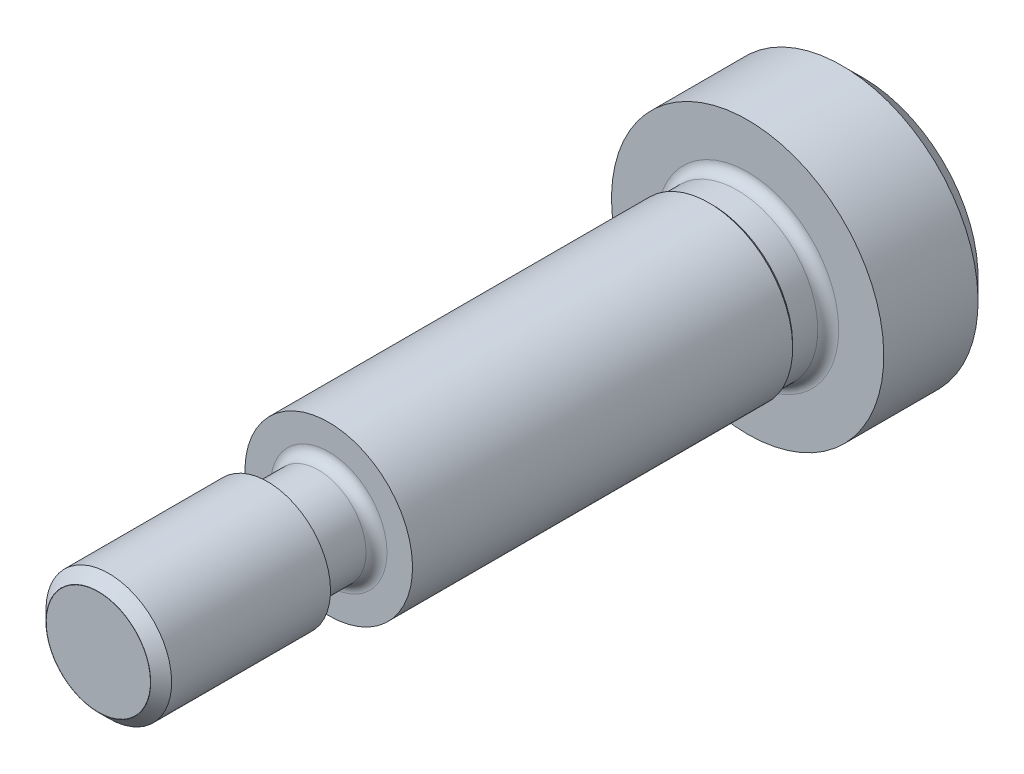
ISO-10303-21;
HEADER;
FILE_DESCRIPTION(('STEP AP214'),'2;1');
FILE_NAME('part.step','',(''),(''),'','','');
FILE_SCHEMA(('AUTOMOTIVE_DESIGN { 1 0 10303 214 1 1 1 1 }'));
ENDSEC;
DATA;
#1=APPLICATION_CONTEXT('core data for automotive mechanical design processes');
#2=APPLICATION_PROTOCOL_DEFINITION('international standard','automotive_design',2000,#1);
#3=PRODUCT_CONTEXT('',#1,'mechanical');
#4=PRODUCT('Part','Part','',(#3));
#5=PRODUCT_RELATED_PRODUCT_CATEGORY('part','',(#4));
#6=PRODUCT_DEFINITION_FORMATION('','',#4);
#7=PRODUCT_DEFINITION_CONTEXT('part definition',#1,'design');
#8=PRODUCT_DEFINITION('design','',#6,#7);
#9=PRODUCT_DEFINITION_SHAPE('','',#8);
#10=(LENGTH_UNIT() NAMED_UNIT(*) SI_UNIT(.MILLI.,.METRE.));
#11=(NAMED_UNIT(*) PLANE_ANGLE_UNIT() SI_UNIT($,.RADIAN.));
#12=(NAMED_UNIT(*) SI_UNIT($,.STERADIAN.) SOLID_ANGLE_UNIT());
#13=UNCERTAINTY_MEASURE_WITH_UNIT(LENGTH_MEASURE(1.E-05),#10,'distance_accuracy_value','');
#14=(GEOMETRIC_REPRESENTATION_CONTEXT(3) GLOBAL_UNCERTAINTY_ASSIGNED_CONTEXT((#13)) GLOBAL_UNIT_ASSIGNED_CONTEXT((#10,
#11,#12)) REPRESENTATION_CONTEXT('',''));
#15=CARTESIAN_POINT('',(0.,0.,0.));
#16=DIRECTION('',(0.,0.,1.));
#17=DIRECTION('',(1.,0.,0.));
#18=AXIS2_PLACEMENT_3D('',#15,#16,#17);
#19=CARTESIAN_POINT('',(0.,6.5,0.));
#20=DIRECTION('',(0.,0.,-1.));
#21=DIRECTION('',(0.,1.,0.));
#22=AXIS2_PLACEMENT_3D('',#19,#20,#21);
#23=PLANE('',#22);
#24=CARTESIAN_POINT('',(0.,0.,0.));
#25=DIRECTION('',(0.,0.,1.));
#26=DIRECTION('',(0.,-1.,0.));
#27=AXIS2_PLACEMENT_3D('',#24,#25,#26);
#28=CIRCLE('',#27,4.35);
#29=CARTESIAN_POINT('',(0.,-4.35,0.));
#30=VERTEX_POINT('',#29);
#31=EDGE_CURVE('E211',#30,#30,#28,.T.);
#32=ORIENTED_EDGE('',*,*,#31,.F.);
#33=EDGE_LOOP('',(#32));
#34=FACE_BOUND('',#33,.T.);
#35=CARTESIAN_POINT('',(0.,0.,0.));
#36=DIRECTION('',(0.,0.,1.));
#37=DIRECTION('',(0.,-1.,0.));
#38=AXIS2_PLACEMENT_3D('',#35,#36,#37);
#39=CIRCLE('',#38,6.5);
#40=CARTESIAN_POINT('',(0.,-6.5,0.));
#41=VERTEX_POINT('',#40);
#42=EDGE_CURVE('E149',#41,#41,#39,.T.);
#43=ORIENTED_EDGE('',*,*,#42,.T.);
#44=EDGE_LOOP('',(#43));
#45=FACE_BOUND('',#44,.T.);
#46=ADVANCED_FACE('F36',(#34,#45),#23,.F.);
#47=CARTESIAN_POINT('',(0.,0.,0.5));
#48=DIRECTION('',(0.,0.,1.));
#49=DIRECTION('',(0.,-1.,0.));
#50=AXIS2_PLACEMENT_3D('',#47,#48,#49);
#51=TOROIDAL_SURFACE('',#50,4.35,0.499999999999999);
#52=CARTESIAN_POINT('',(0.,0.,0.5));
#53=DIRECTION('',(0.,0.,1.));
#54=DIRECTION('',(0.,-1.,0.));
#55=AXIS2_PLACEMENT_3D('',#52,#53,#54);
#56=CIRCLE('',#55,3.85);
#57=CARTESIAN_POINT('',(0.,-3.85,0.5));
#58=VERTEX_POINT('',#57);
#59=EDGE_CURVE('E208',#58,#58,#56,.T.);
#60=ORIENTED_EDGE('',*,*,#59,.F.);
#61=EDGE_LOOP('',(#60));
#62=FACE_BOUND('',#61,.T.);
#63=ORIENTED_EDGE('',*,*,#31,.T.);
#64=EDGE_LOOP('',(#63));
#65=FACE_BOUND('',#64,.T.);
#66=ADVANCED_FACE('F274',(#62,#65),#51,.F.);
#67=CARTESIAN_POINT('',(0.,0.,-0.998278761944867));
#68=DIRECTION('',(0.,0.,1.));
#69=DIRECTION('',(0.,-1.,0.));
#70=AXIS2_PLACEMENT_3D('',#67,#68,#69);
#71=CYLINDRICAL_SURFACE('',#70,3.85);
#72=CARTESIAN_POINT('',(0.,0.,1.7));
#73=DIRECTION('',(0.,0.,1.));
#74=DIRECTION('',(0.,-1.,0.));
#75=AXIS2_PLACEMENT_3D('',#72,#73,#74);
#76=CIRCLE('',#75,3.85);
#77=CARTESIAN_POINT('',(0.,-3.85,1.7));
#78=VERTEX_POINT('',#77);
#79=EDGE_CURVE('E205',#78,#78,#76,.T.);
#80=ORIENTED_EDGE('',*,*,#79,.F.);
#81=EDGE_LOOP('',(#80));
#82=FACE_BOUND('',#81,.T.);
#83=ORIENTED_EDGE('',*,*,#59,.T.);
#84=EDGE_LOOP('',(#83));
#85=FACE_BOUND('',#84,.T.);
#86=ADVANCED_FACE('F279',(#82,#85),#71,.T.);
#87=CARTESIAN_POINT('',(0.,0.,1.7));
#88=DIRECTION('',(0.,0.,1.));
#89=DIRECTION('',(0.,-1.,0.));
#90=AXIS2_PLACEMENT_3D('',#87,#88,#89);
#91=CONICAL_SURFACE('',#90,3.85,0.785398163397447);
#92=CARTESIAN_POINT('',(0.,0.,1.85));
#93=DIRECTION('',(0.,0.,1.));
#94=DIRECTION('',(0.,-1.,0.));
#95=AXIS2_PLACEMENT_3D('',#92,#93,#94);
#96=CIRCLE('',#95,4.);
#97=CARTESIAN_POINT('',(0.,-4.,1.85));
#98=VERTEX_POINT('',#97);
#99=EDGE_CURVE('E202',#98,#98,#96,.T.);
#100=ORIENTED_EDGE('',*,*,#99,.F.);
#101=EDGE_LOOP('',(#100));
#102=FACE_BOUND('',#101,.T.);
#103=ORIENTED_EDGE('',*,*,#79,.T.);
#104=EDGE_LOOP('',(#103));
#105=FACE_BOUND('',#104,.T.);
#106=ADVANCED_FACE('F346',(#102,#105),#91,.T.);
#107=CARTESIAN_POINT('',(0.,0.,-0.998278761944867));
#108=DIRECTION('',(0.,0.,1.));
#109=DIRECTION('',(0.,-1.,0.));
#110=AXIS2_PLACEMENT_3D('',#107,#108,#109);
#111=CYLINDRICAL_SURFACE('',#110,4.);
#112=CARTESIAN_POINT('',(0.,0.,20.));
#113=DIRECTION('',(0.,0.,1.));
#114=DIRECTION('',(0.,-1.,0.));
#115=AXIS2_PLACEMENT_3D('',#112,#113,#114);
#116=CIRCLE('',#115,4.);
#117=CARTESIAN_POINT('',(0.,-4.,20.));
#118=VERTEX_POINT('',#117);
#119=EDGE_CURVE('E199',#118,#118,#116,.T.);
#120=ORIENTED_EDGE('',*,*,#119,.F.);
#121=EDGE_LOOP('',(#120));
#122=FACE_BOUND('',#121,.T.);
#123=ORIENTED_EDGE('',*,*,#99,.T.);
#124=EDGE_LOOP('',(#123));
#125=FACE_BOUND('',#124,.T.);
#126=ADVANCED_FACE('F342',(#122,#125),#111,.T.);
#127=CARTESIAN_POINT('',(0.,4.,20.));
#128=DIRECTION('',(0.,0.,-1.));
#129=DIRECTION('',(0.,1.,0.));
#130=AXIS2_PLACEMENT_3D('',#127,#128,#129);
#131=PLANE('',#130);
#132=CARTESIAN_POINT('',(0.,0.,20.));
#133=DIRECTION('',(0.,0.,1.));
#134=DIRECTION('',(0.,-1.,0.));
#135=AXIS2_PLACEMENT_3D('',#132,#133,#134);
#136=CIRCLE('',#135,2.78);
#137=CARTESIAN_POINT('',(0.,-2.78,20.));
#138=VERTEX_POINT('',#137);
#139=EDGE_CURVE('E196',#138,#138,#136,.T.);
#140=ORIENTED_EDGE('',*,*,#139,.F.);
#141=EDGE_LOOP('',(#140));
#142=FACE_BOUND('',#141,.T.);
#143=ORIENTED_EDGE('',*,*,#119,.T.);
#144=EDGE_LOOP('',(#143));
#145=FACE_BOUND('',#144,.T.);
#146=ADVANCED_FACE('F338',(#142,#145),#131,.F.);
#147=CARTESIAN_POINT('',(0.,0.,20.5));
#148=DIRECTION('',(0.,0.,1.));
#149=DIRECTION('',(0.,-1.,0.));
#150=AXIS2_PLACEMENT_3D('',#147,#148,#149);
#151=TOROIDAL_SURFACE('',#150,2.78,0.5);
#152=CARTESIAN_POINT('',(0.,0.,20.5));
#153=DIRECTION('',(0.,0.,1.));
#154=DIRECTION('',(0.,-1.,0.));
#155=AXIS2_PLACEMENT_3D('',#152,#153,#154);
#156=CIRCLE('',#155,2.28);
#157=CARTESIAN_POINT('',(0.,-2.28,20.5));
#158=VERTEX_POINT('',#157);
#159=EDGE_CURVE('E193',#158,#158,#156,.T.);
#160=ORIENTED_EDGE('',*,*,#159,.F.);
#161=EDGE_LOOP('',(#160));
#162=FACE_BOUND('',#161,.T.);
#163=ORIENTED_EDGE('',*,*,#139,.T.);
#164=EDGE_LOOP('',(#163));
#165=FACE_BOUND('',#164,.T.);
#166=ADVANCED_FACE('F334',(#162,#165),#151,.F.);
#167=CARTESIAN_POINT('',(0.,0.,-0.998278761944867));
#168=DIRECTION('',(0.,0.,1.));
#169=DIRECTION('',(0.,-1.,0.));
#170=AXIS2_PLACEMENT_3D('',#167,#168,#169);
#171=CYLINDRICAL_SURFACE('',#170,2.28);
#172=CARTESIAN_POINT('',(0.,0.,22.5));
#173=DIRECTION('',(0.,0.,1.));
#174=DIRECTION('',(0.,-1.,0.));
#175=AXIS2_PLACEMENT_3D('',#172,#173,#174);
#176=CIRCLE('',#175,2.28);
#177=CARTESIAN_POINT('',(0.,-2.28,22.5));
#178=VERTEX_POINT('',#177);
#179=EDGE_CURVE('E190',#178,#178,#176,.T.);
#180=ORIENTED_EDGE('',*,*,#179,.F.);
#181=EDGE_LOOP('',(#180));
#182=FACE_BOUND('',#181,.T.);
#183=ORIENTED_EDGE('',*,*,#159,.T.);
#184=EDGE_LOOP('',(#183));
#185=FACE_BOUND('',#184,.T.);
#186=ADVANCED_FACE('F330',(#182,#185),#171,.T.);
#187=CARTESIAN_POINT('',(0.,0.,22.5));
#188=DIRECTION('',(0.,0.,1.));
#189=DIRECTION('',(0.,-1.,0.));
#190=AXIS2_PLACEMENT_3D('',#187,#188,#189);
#191=CONICAL_SURFACE('',#190,2.28,1.0471975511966);
#192=CARTESIAN_POINT('',(0.,0.,22.9156921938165));
#193=DIRECTION('',(0.,0.,1.));
#194=DIRECTION('',(0.,-1.,0.));
#195=AXIS2_PLACEMENT_3D('',#192,#193,#194);
#196=CIRCLE('',#195,3.);
#197=CARTESIAN_POINT('',(0.,-3.,22.9156921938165));
#198=VERTEX_POINT('',#197);
#199=EDGE_CURVE('E187',#198,#198,#196,.T.);
#200=ORIENTED_EDGE('',*,*,#199,.F.);
#201=EDGE_LOOP('',(#200));
#202=FACE_BOUND('',#201,.T.);
#203=ORIENTED_EDGE('',*,*,#179,.T.);
#204=EDGE_LOOP('',(#203));
#205=FACE_BOUND('',#204,.T.);
#206=ADVANCED_FACE('F326',(#202,#205),#191,.T.);
#207=CARTESIAN_POINT('',(0.,0.,-0.998278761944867));
#208=DIRECTION('',(0.,0.,1.));
#209=DIRECTION('',(0.,-1.,0.));
#210=AXIS2_PLACEMENT_3D('',#207,#208,#209);
#211=CYLINDRICAL_SURFACE('',#210,3.);
#212=CARTESIAN_POINT('',(0.,0.,30.5));
#213=DIRECTION('',(0.,0.,1.));
#214=DIRECTION('',(0.,-1.,0.));
#215=AXIS2_PLACEMENT_3D('',#212,#213,#214);
#216=CIRCLE('',#215,3.);
#217=CARTESIAN_POINT('',(0.,-3.,30.5));
#218=VERTEX_POINT('',#217);
#219=EDGE_CURVE('E184',#218,#218,#216,.T.);
#220=ORIENTED_EDGE('',*,*,#219,.F.);
#221=EDGE_LOOP('',(#220));
#222=FACE_BOUND('',#221,.T.);
#223=ORIENTED_EDGE('',*,*,#199,.T.);
#224=EDGE_LOOP('',(#223));
#225=FACE_BOUND('',#224,.T.);
#226=ADVANCED_FACE('F322',(#222,#225),#211,.T.);
#227=CARTESIAN_POINT('',(0.,0.,30.5));
#228=DIRECTION('',(0.,0.,-1.));
#229=DIRECTION('',(0.,1.,0.));
#230=AXIS2_PLACEMENT_3D('',#227,#228,#229);
#231=CONICAL_SURFACE('',#230,3.,0.785398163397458);
#232=CARTESIAN_POINT('',(0.,0.,31.));
#233=DIRECTION('',(0.,0.,1.));
#234=DIRECTION('',(0.,-1.,0.));
#235=AXIS2_PLACEMENT_3D('',#232,#233,#234);
#236=CIRCLE('',#235,2.5);
#237=CARTESIAN_POINT('',(0.,-2.5,31.));
#238=VERTEX_POINT('',#237);
#239=EDGE_CURVE('E181',#238,#238,#236,.T.);
#240=ORIENTED_EDGE('',*,*,#239,.F.);
#241=EDGE_LOOP('',(#240));
#242=FACE_BOUND('',#241,.T.);
#243=ORIENTED_EDGE('',*,*,#219,.T.);
#244=EDGE_LOOP('',(#243));
#245=FACE_BOUND('',#244,.T.);
#246=ADVANCED_FACE('F318',(#242,#245),#231,.T.);
#247=CARTESIAN_POINT('',(0.,0.,-0.998278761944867));
#248=DIRECTION('',(0.,0.,1.));
#249=DIRECTION('',(0.,-1.,0.));
#250=AXIS2_PLACEMENT_3D('',#247,#248,#249);
#251=CYLINDRICAL_SURFACE('',#250,2.5);
#252=CARTESIAN_POINT('',(0.,0.,22.6385640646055));
#253=DIRECTION('',(0.,0.,1.));
#254=DIRECTION('',(0.,-1.,0.));
#255=AXIS2_PLACEMENT_3D('',#252,#253,#254);
#256=CIRCLE('',#255,2.5);
#257=CARTESIAN_POINT('',(0.,-2.5,22.6385640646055));
#258=VERTEX_POINT('',#257);
#259=EDGE_CURVE('E178',#258,#258,#256,.T.);
#260=ORIENTED_EDGE('',*,*,#259,.F.);
#261=EDGE_LOOP('',(#260));
#262=FACE_BOUND('',#261,.T.);
#263=ORIENTED_EDGE('',*,*,#239,.T.);
#264=EDGE_LOOP('',(#263));
#265=FACE_BOUND('',#264,.T.);
#266=ADVANCED_FACE('F314',(#262,#265),#251,.F.);
#267=CARTESIAN_POINT('',(0.,0.,22.6385640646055));
#268=DIRECTION('',(0.,0.,1.));
#269=DIRECTION('',(0.,-1.,0.));
#270=AXIS2_PLACEMENT_3D('',#267,#268,#269);
#271=CONICAL_SURFACE('',#270,2.5,1.04719755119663);
#272=CARTESIAN_POINT('',(0.,0.,22.6327905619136));
#273=DIRECTION('',(0.,0.,1.));
#274=DIRECTION('',(0.,-1.,0.));
#275=AXIS2_PLACEMENT_3D('',#272,#273,#274);
#276=CIRCLE('',#275,2.48999999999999);
#277=CARTESIAN_POINT('',(0.,-2.48999999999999,22.6327905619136));
#278=VERTEX_POINT('',#277);
#279=EDGE_CURVE('E175',#278,#278,#276,.T.);
#280=ORIENTED_EDGE('',*,*,#279,.F.);
#281=EDGE_LOOP('',(#280));
#282=FACE_BOUND('',#281,.T.);
#283=ORIENTED_EDGE('',*,*,#259,.T.);
#284=EDGE_LOOP('',(#283));
#285=FACE_BOUND('',#284,.T.);
#286=ADVANCED_FACE('F310',(#282,#285),#271,.F.);
#287=CARTESIAN_POINT('',(0.,0.,-0.998278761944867));
#288=DIRECTION('',(0.,0.,1.));
#289=DIRECTION('',(0.,-1.,0.));
#290=AXIS2_PLACEMENT_3D('',#287,#288,#289);
#291=CYLINDRICAL_SURFACE('',#290,2.48999999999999);
#292=CARTESIAN_POINT('',(0.,0.,31.));
#293=DIRECTION('',(0.,0.,1.));
#294=DIRECTION('',(0.,-1.,0.));
#295=AXIS2_PLACEMENT_3D('',#292,#293,#294);
#296=CIRCLE('',#295,2.48999999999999);
#297=CARTESIAN_POINT('',(0.,-2.48999999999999,31.));
#298=VERTEX_POINT('',#297);
#299=EDGE_CURVE('E171',#298,#298,#296,.T.);
#300=ORIENTED_EDGE('',*,*,#299,.F.);
#301=EDGE_LOOP('',(#300));
#302=FACE_BOUND('',#301,.T.);
#303=ORIENTED_EDGE('',*,*,#279,.T.);
#304=EDGE_LOOP('',(#303));
#305=FACE_BOUND('',#304,.T.);
#306=ADVANCED_FACE('F302',(#302,#305),#291,.T.);
#307=CARTESIAN_POINT('',(0.,2.48999999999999,31.));
#308=DIRECTION('',(0.,0.,-1.));
#309=DIRECTION('',(0.,1.,0.));
#310=AXIS2_PLACEMENT_3D('',#307,#308,#309);
#311=PLANE('',#310);
#312=ORIENTED_EDGE('',*,*,#299,.T.);
#313=EDGE_LOOP('',(#312));
#314=FACE_BOUND('',#313,.T.);
#315=ADVANCED_FACE('F297',(#314),#311,.F.);
#316=CARTESIAN_POINT('',(0.,2.,-5.5));
#317=DIRECTION('',(0.,0.,1.));
#318=DIRECTION('',(0.,-1.,0.));
#319=AXIS2_PLACEMENT_3D('',#316,#317,#318);
#320=PLANE('',#319);
#321=CARTESIAN_POINT('',(0.,0.,-5.5));
#322=DIRECTION('',(0.,0.,1.));
#323=DIRECTION('',(0.,-1.,0.));
#324=AXIS2_PLACEMENT_3D('',#321,#322,#323);
#325=CIRCLE('',#324,5.50000000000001);
#326=CARTESIAN_POINT('',(0.,-5.50000000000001,-5.5));
#327=VERTEX_POINT('',#326);
#328=EDGE_CURVE('E166',#327,#327,#325,.T.);
#329=ORIENTED_EDGE('',*,*,#328,.F.);
#330=EDGE_LOOP('',(#329));
#331=FACE_BOUND('',#330,.T.);
#332=DIRECTION('',(0.5,-0.866025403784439,0.));
#333=VECTOR('',#332,1.);
#334=CARTESIAN_POINT('',(-2.59807621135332,0.500000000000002,-5.5));
#335=LINE('',#334,#333);
#336=CARTESIAN_POINT('',(-2.3094010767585,0.,-5.5));
#337=VERTEX_POINT('',#336);
#338=CARTESIAN_POINT('',(-1.15470053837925,-2.00000000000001,-5.5));
#339=VERTEX_POINT('',#338);
#340=EDGE_CURVE('E57',#337,#339,#335,.T.);
#341=ORIENTED_EDGE('',*,*,#340,.T.);
#342=DIRECTION('',(1.,0.,0.));
#343=VECTOR('',#342,1.);
#344=CARTESIAN_POINT('',(0.,-2.,-5.5));
#345=LINE('',#344,#343);
#346=CARTESIAN_POINT('',(1.15470053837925,-2.,-5.5));
#347=VERTEX_POINT('',#346);
#348=EDGE_CURVE('E11',#339,#347,#345,.T.);
#349=ORIENTED_EDGE('',*,*,#348,.T.);
#350=DIRECTION('',(0.5,0.866025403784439,0.));
#351=VECTOR('',#350,1.);
#352=CARTESIAN_POINT('',(2.59807621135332,0.500000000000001,-5.5));
#353=LINE('',#352,#351);
#354=CARTESIAN_POINT('',(2.3094010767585,0.,-5.5));
#355=VERTEX_POINT('',#354);
#356=EDGE_CURVE('E43',#347,#355,#353,.T.);
#357=ORIENTED_EDGE('',*,*,#356,.T.);
#358=DIRECTION('',(-0.5,0.866025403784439,0.));
#359=VECTOR('',#358,1.);
#360=CARTESIAN_POINT('',(0.866025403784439,2.5,-5.5));
#361=LINE('',#360,#359);
#362=CARTESIAN_POINT('',(1.15470053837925,2.,-5.49999999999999));
#363=VERTEX_POINT('',#362);
#364=EDGE_CURVE('E219',#355,#363,#361,.T.);
#365=ORIENTED_EDGE('',*,*,#364,.T.);
#366=DIRECTION('',(-1.,0.,0.));
#367=VECTOR('',#366,1.);
#368=CARTESIAN_POINT('',(0.,2.,-5.5));
#369=LINE('',#368,#367);
#370=CARTESIAN_POINT('',(-1.15470053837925,2.,-5.49999999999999));
#371=VERTEX_POINT('',#370);
#372=EDGE_CURVE('E217',#363,#371,#369,.T.);
#373=ORIENTED_EDGE('',*,*,#372,.T.);
#374=DIRECTION('',(-0.5,-0.866025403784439,0.));
#375=VECTOR('',#374,1.);
#376=CARTESIAN_POINT('',(-0.866025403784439,2.5,-5.5));
#377=LINE('',#376,#375);
#378=EDGE_CURVE('E215',#371,#337,#377,.T.);
#379=ORIENTED_EDGE('',*,*,#378,.T.);
#380=EDGE_LOOP('',(#341,#349,#357,#365,#373,#379));
#381=FACE_BOUND('',#380,.T.);
#382=ADVANCED_FACE('F222',(#331,#381),#320,.F.);
#383=CARTESIAN_POINT('',(0.,0.,-5.5));
#384=DIRECTION('',(0.,0.,1.));
#385=DIRECTION('',(0.,-1.,0.));
#386=AXIS2_PLACEMENT_3D('',#383,#384,#385);
#387=CONICAL_SURFACE('',#386,5.50000000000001,0.785398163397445);
#388=CARTESIAN_POINT('',(0.,0.,-4.5));
#389=DIRECTION('',(0.,0.,1.));
#390=DIRECTION('',(0.,-1.,0.));
#391=AXIS2_PLACEMENT_3D('',#388,#389,#390);
#392=CIRCLE('',#391,6.5);
#393=CARTESIAN_POINT('',(0.,-6.5,-4.5));
#394=VERTEX_POINT('',#393);
#395=EDGE_CURVE('E163',#394,#394,#392,.T.);
#396=ORIENTED_EDGE('',*,*,#395,.F.);
#397=EDGE_LOOP('',(#396));
#398=FACE_BOUND('',#397,.T.);
#399=ORIENTED_EDGE('',*,*,#328,.T.);
#400=EDGE_LOOP('',(#399));
#401=FACE_BOUND('',#400,.T.);
#402=ADVANCED_FACE('F287',(#398,#401),#387,.T.);
#403=CARTESIAN_POINT('',(0.,0.,-0.998278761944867));
#404=DIRECTION('',(0.,0.,1.));
#405=DIRECTION('',(0.,-1.,0.));
#406=AXIS2_PLACEMENT_3D('',#403,#404,#405);
#407=CYLINDRICAL_SURFACE('',#406,6.5);
#408=ORIENTED_EDGE('',*,*,#42,.F.);
#409=EDGE_LOOP('',(#408));
#410=FACE_BOUND('',#409,.T.);
#411=ORIENTED_EDGE('',*,*,#395,.T.);
#412=EDGE_LOOP('',(#411));
#413=FACE_BOUND('',#412,.T.);
#414=ADVANCED_FACE('F272',(#410,#413),#407,.T.);
#415=CARTESIAN_POINT('',(0.,0.,-2.2));
#416=DIRECTION('',(0.,0.,-1.));
#417=DIRECTION('',(0.,1.,0.));
#418=AXIS2_PLACEMENT_3D('',#415,#416,#417);
#419=PLANE('',#418);
#420=CARTESIAN_POINT('',(0.,0.,-2.2));
#421=DIRECTION('',(0.,0.,1.));
#422=DIRECTION('',(0.,-1.,0.));
#423=AXIS2_PLACEMENT_3D('',#420,#421,#422);
#424=CIRCLE('',#423,2.);
#425=CARTESIAN_POINT('',(0.,1.99999999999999,-2.2));
#426=VERTEX_POINT('',#425);
#427=CARTESIAN_POINT('',(-1.73205080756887,0.999999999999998,-2.2));
#428=VERTEX_POINT('',#427);
#429=EDGE_CURVE('E244',#426,#428,#424,.T.);
#430=ORIENTED_EDGE('',*,*,#429,.T.);
#431=DIRECTION('',(0.5,0.866025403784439,0.));
#432=VECTOR('',#431,1.);
#433=CARTESIAN_POINT('',(-2.3094010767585,0.,-2.2));
#434=LINE('',#433,#432);
#435=CARTESIAN_POINT('',(-1.15470053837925,1.99999999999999,-2.2));
#436=VERTEX_POINT('',#435);
#437=EDGE_CURVE('E132',#428,#436,#434,.T.);
#438=ORIENTED_EDGE('',*,*,#437,.T.);
#439=DIRECTION('',(1.,0.,0.));
#440=VECTOR('',#439,1.);
#441=CARTESIAN_POINT('',(-1.15470053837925,1.99999999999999,-2.2));
#442=LINE('',#441,#440);
#443=EDGE_CURVE('E139',#436,#426,#442,.T.);
#444=ORIENTED_EDGE('',*,*,#443,.T.);
#445=EDGE_LOOP('',(#430,#438,#444));
#446=FACE_BOUND('',#445,.T.);
#447=ADVANCED_FACE('F258',(#446),#419,.T.);
#448=CARTESIAN_POINT('',(-1.73205080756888,-1.,-2.20000000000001));
#449=VERTEX_POINT('',#448);
#450=EDGE_CURVE('E246',#428,#449,#424,.T.);
#451=ORIENTED_EDGE('',*,*,#450,.T.);
#452=DIRECTION('',(-0.5,0.866025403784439,0.));
#453=VECTOR('',#452,1.);
#454=CARTESIAN_POINT('',(-1.15470053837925,-2.00000000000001,-2.20000000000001));
#455=LINE('',#454,#453);
#456=CARTESIAN_POINT('',(-2.3094010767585,0.,-2.2));
#457=VERTEX_POINT('',#456);
#458=EDGE_CURVE('E131',#449,#457,#455,.T.);
#459=ORIENTED_EDGE('',*,*,#458,.T.);
#460=EDGE_CURVE('E134',#457,#428,#434,.T.);
#461=ORIENTED_EDGE('',*,*,#460,.T.);
#462=EDGE_LOOP('',(#451,#459,#461));
#463=FACE_BOUND('',#462,.T.);
#464=ADVANCED_FACE('F251',(#463),#419,.T.);
#465=CARTESIAN_POINT('',(0.,-2.00000000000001,-2.20000000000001));
#466=VERTEX_POINT('',#465);
#467=EDGE_CURVE('E114',#449,#466,#424,.T.);
#468=ORIENTED_EDGE('',*,*,#467,.T.);
#469=DIRECTION('',(-1.,0.,0.));
#470=VECTOR('',#469,1.);
#471=CARTESIAN_POINT('',(1.15470053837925,-2.00000000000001,-2.20000000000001));
#472=LINE('',#471,#470);
#473=CARTESIAN_POINT('',(-1.15470053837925,-2.00000000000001,-2.20000000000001));
#474=VERTEX_POINT('',#473);
#475=EDGE_CURVE('E108',#466,#474,#472,.T.);
#476=ORIENTED_EDGE('',*,*,#475,.T.);
#477=EDGE_CURVE('E112',#474,#449,#455,.T.);
#478=ORIENTED_EDGE('',*,*,#477,.T.);
#479=EDGE_LOOP('',(#468,#476,#478));
#480=FACE_BOUND('',#479,.T.);
#481=ADVANCED_FACE('F110',(#480),#419,.T.);
#482=CARTESIAN_POINT('',(1.73205080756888,-1.,-2.20000000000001));
#483=VERTEX_POINT('',#482);
#484=EDGE_CURVE('E169',#466,#483,#424,.T.);
#485=ORIENTED_EDGE('',*,*,#484,.T.);
#486=DIRECTION('',(-0.5,-0.866025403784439,0.));
#487=VECTOR('',#486,1.);
#488=CARTESIAN_POINT('',(2.3094010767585,0.,-2.2));
#489=LINE('',#488,#487);
#490=CARTESIAN_POINT('',(1.15470053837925,-2.00000000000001,-2.20000000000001));
#491=VERTEX_POINT('',#490);
#492=EDGE_CURVE('E144',#483,#491,#489,.T.);
#493=ORIENTED_EDGE('',*,*,#492,.T.);
#494=EDGE_CURVE('E118',#491,#466,#472,.T.);
#495=ORIENTED_EDGE('',*,*,#494,.T.);
#496=EDGE_LOOP('',(#485,#493,#495));
#497=FACE_BOUND('',#496,.T.);
#498=ADVANCED_FACE('F269',(#497),#419,.T.);
#499=CARTESIAN_POINT('',(1.73205080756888,0.999999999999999,-2.2));
#500=VERTEX_POINT('',#499);
#501=EDGE_CURVE('E172',#483,#500,#424,.T.);
#502=ORIENTED_EDGE('',*,*,#501,.T.);
#503=DIRECTION('',(0.5,-0.866025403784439,0.));
#504=VECTOR('',#503,1.);
#505=CARTESIAN_POINT('',(1.15470053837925,1.99999999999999,-2.2));
#506=LINE('',#505,#504);
#507=CARTESIAN_POINT('',(2.3094010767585,0.,-2.2));
#508=VERTEX_POINT('',#507);
#509=EDGE_CURVE('E142',#500,#508,#506,.T.);
#510=ORIENTED_EDGE('',*,*,#509,.T.);
#511=EDGE_CURVE('E126',#508,#483,#489,.T.);
#512=ORIENTED_EDGE('',*,*,#511,.T.);
#513=EDGE_LOOP('',(#502,#510,#512));
#514=FACE_BOUND('',#513,.T.);
#515=ADVANCED_FACE('F236',(#514),#419,.T.);
#516=EDGE_CURVE('E243',#500,#426,#424,.T.);
#517=ORIENTED_EDGE('',*,*,#516,.T.);
#518=CARTESIAN_POINT('',(1.15470053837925,1.99999999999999,-2.2));
#519=VERTEX_POINT('',#518);
#520=EDGE_CURVE('E138',#426,#519,#442,.T.);
#521=ORIENTED_EDGE('',*,*,#520,.T.);
#522=EDGE_CURVE('E50',#519,#500,#506,.T.);
#523=ORIENTED_EDGE('',*,*,#522,.T.);
#524=EDGE_LOOP('',(#517,#521,#523));
#525=FACE_BOUND('',#524,.T.);
#526=ADVANCED_FACE('F261',(#525),#419,.T.);
#527=CARTESIAN_POINT('',(1.15470053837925,-2.00000000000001,-2.20000000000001));
#528=DIRECTION('',(0.,-1.,0.));
#529=DIRECTION('',(0.,0.,-1.));
#530=AXIS2_PLACEMENT_3D('',#527,#528,#529);
#531=PLANE('',#530);
#532=ORIENTED_EDGE('',*,*,#494,.F.);
#533=DIRECTION('',(0.,0.,-1.));
#534=VECTOR('',#533,1.);
#535=CARTESIAN_POINT('',(1.15470053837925,-2.00000000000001,-2.20000000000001));
#536=LINE('',#535,#534);
#537=EDGE_CURVE('E147',#491,#347,#536,.T.);
#538=ORIENTED_EDGE('',*,*,#537,.T.);
#539=ORIENTED_EDGE('',*,*,#348,.F.);
#540=DIRECTION('',(0.,0.,-1.));
#541=VECTOR('',#540,1.);
#542=CARTESIAN_POINT('',(-1.15470053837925,-2.00000000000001,-2.20000000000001));
#543=LINE('',#542,#541);
#544=EDGE_CURVE('E121',#474,#339,#543,.T.);
#545=ORIENTED_EDGE('',*,*,#544,.F.);
#546=ORIENTED_EDGE('',*,*,#475,.F.);
#547=EDGE_LOOP('',(#532,#538,#539,#545,#546));
#548=FACE_BOUND('',#547,.T.);
#549=ADVANCED_FACE('F122',(#548),#531,.F.);
#550=CARTESIAN_POINT('',(2.3094010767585,0.,-2.2));
#551=DIRECTION('',(0.866025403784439,-0.5,0.));
#552=DIRECTION('',(0.5,0.866025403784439,0.));
#553=AXIS2_PLACEMENT_3D('',#550,#551,#552);
#554=PLANE('',#553);
#555=ORIENTED_EDGE('',*,*,#511,.F.);
#556=DIRECTION('',(0.,0.,-1.));
#557=VECTOR('',#556,1.);
#558=CARTESIAN_POINT('',(2.3094010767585,0.,-2.2));
#559=LINE('',#558,#557);
#560=EDGE_CURVE('E150',#508,#355,#559,.T.);
#561=ORIENTED_EDGE('',*,*,#560,.T.);
#562=ORIENTED_EDGE('',*,*,#356,.F.);
#563=ORIENTED_EDGE('',*,*,#537,.F.);
#564=ORIENTED_EDGE('',*,*,#492,.F.);
#565=EDGE_LOOP('',(#555,#561,#562,#563,#564));
#566=FACE_BOUND('',#565,.T.);
#567=ADVANCED_FACE('F231',(#566),#554,.F.);
#568=CARTESIAN_POINT('',(1.15470053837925,1.99999999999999,-2.2));
#569=DIRECTION('',(0.866025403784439,0.5,0.));
#570=DIRECTION('',(-0.5,0.866025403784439,0.));
#571=AXIS2_PLACEMENT_3D('',#568,#569,#570);
#572=PLANE('',#571);
#573=ORIENTED_EDGE('',*,*,#522,.F.);
#574=DIRECTION('',(0.,0.,-1.));
#575=VECTOR('',#574,1.);
#576=CARTESIAN_POINT('',(1.15470053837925,1.99999999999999,-2.2));
#577=LINE('',#576,#575);
#578=EDGE_CURVE('E153',#519,#363,#577,.T.);
#579=ORIENTED_EDGE('',*,*,#578,.T.);
#580=ORIENTED_EDGE('',*,*,#364,.F.);
#581=ORIENTED_EDGE('',*,*,#560,.F.);
#582=ORIENTED_EDGE('',*,*,#509,.F.);
#583=EDGE_LOOP('',(#573,#579,#580,#581,#582));
#584=FACE_BOUND('',#583,.T.);
#585=ADVANCED_FACE('F228',(#584),#572,.F.);
#586=CARTESIAN_POINT('',(-1.15470053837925,1.99999999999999,-2.2));
#587=DIRECTION('',(0.,1.,0.));
#588=DIRECTION('',(0.,0.,1.));
#589=AXIS2_PLACEMENT_3D('',#586,#587,#588);
#590=PLANE('',#589);
#591=ORIENTED_EDGE('',*,*,#443,.F.);
#592=DIRECTION('',(0.,0.,-1.));
#593=VECTOR('',#592,1.);
#594=CARTESIAN_POINT('',(-1.15470053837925,1.99999999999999,-2.2));
#595=LINE('',#594,#593);
#596=EDGE_CURVE('E156',#436,#371,#595,.T.);
#597=ORIENTED_EDGE('',*,*,#596,.T.);
#598=ORIENTED_EDGE('',*,*,#372,.F.);
#599=ORIENTED_EDGE('',*,*,#578,.F.);
#600=ORIENTED_EDGE('',*,*,#520,.F.);
#601=EDGE_LOOP('',(#591,#597,#598,#599,#600));
#602=FACE_BOUND('',#601,.T.);
#603=ADVANCED_FACE('F260',(#602),#590,.F.);
#604=CARTESIAN_POINT('',(-2.3094010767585,0.,-2.2));
#605=DIRECTION('',(-0.866025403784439,0.5,0.));
#606=DIRECTION('',(-0.5,-0.866025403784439,0.));
#607=AXIS2_PLACEMENT_3D('',#604,#605,#606);
#608=PLANE('',#607);
#609=ORIENTED_EDGE('',*,*,#460,.F.);
#610=DIRECTION('',(0.,0.,-1.));
#611=VECTOR('',#610,1.);
#612=CARTESIAN_POINT('',(-2.3094010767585,0.,-2.2));
#613=LINE('',#612,#611);
#614=EDGE_CURVE('E125',#457,#337,#613,.T.);
#615=ORIENTED_EDGE('',*,*,#614,.T.);
#616=ORIENTED_EDGE('',*,*,#378,.F.);
#617=ORIENTED_EDGE('',*,*,#596,.F.);
#618=ORIENTED_EDGE('',*,*,#437,.F.);
#619=EDGE_LOOP('',(#609,#615,#616,#617,#618));
#620=FACE_BOUND('',#619,.T.);
#621=ADVANCED_FACE('F254',(#620),#608,.F.);
#622=CARTESIAN_POINT('',(-1.15470053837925,-2.00000000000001,-2.20000000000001));
#623=DIRECTION('',(-0.866025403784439,-0.5,0.));
#624=DIRECTION('',(0.5,-0.866025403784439,0.));
#625=AXIS2_PLACEMENT_3D('',#622,#623,#624);
#626=PLANE('',#625);
#627=ORIENTED_EDGE('',*,*,#477,.F.);
#628=ORIENTED_EDGE('',*,*,#544,.T.);
#629=ORIENTED_EDGE('',*,*,#340,.F.);
#630=ORIENTED_EDGE('',*,*,#614,.F.);
#631=ORIENTED_EDGE('',*,*,#458,.F.);
#632=EDGE_LOOP('',(#627,#628,#629,#630,#631));
#633=FACE_BOUND('',#632,.T.);
#634=ADVANCED_FACE('F129',(#633),#626,.F.);
#635=CARTESIAN_POINT('',(0.,0.,-0.998278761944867));
#636=DIRECTION('',(0.,0.,-1.));
#637=DIRECTION('',(0.,1.,0.));
#638=AXIS2_PLACEMENT_3D('',#635,#636,#637);
#639=CONICAL_SURFACE('',#638,0.,1.02974425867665);
#640=ORIENTED_EDGE('',*,*,#484,.F.);
#641=ORIENTED_EDGE('',*,*,#467,.F.);
#642=ORIENTED_EDGE('',*,*,#450,.F.);
#643=ORIENTED_EDGE('',*,*,#429,.F.);
#644=ORIENTED_EDGE('',*,*,#516,.F.);
#645=ORIENTED_EDGE('',*,*,#501,.F.);
#646=EDGE_LOOP('',(#640,#641,#642,#643,#644,#645));
#647=FACE_BOUND('',#646,.T.);
#648=CARTESIAN_POINT('',(0.,0.,-0.998278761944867));
#649=VERTEX_POINT('',#648);
#650=VERTEX_LOOP('',#649);
#651=FACE_BOUND('',#650,.T.);
#652=ADVANCED_FACE('F240',(#647,#651),#639,.F.);
#653=CLOSED_SHELL('',(#46,#66,#86,#106,#126,#146,#166,#186,#206,#226,#246,#266,#286,#306,#315,
#382,#402,#414,#447,#464,#481,#498,#515,#526,#549,#567,#585,#603,#621,#634,#652));
#654=MANIFOLD_SOLID_BREP('B2',#653);
#655=ADVANCED_BREP_SHAPE_REPRESENTATION('',(#18,#654),#14);
#656=SHAPE_DEFINITION_REPRESENTATION(#9,#655);
ENDSEC;
END-ISO-10303-21;
